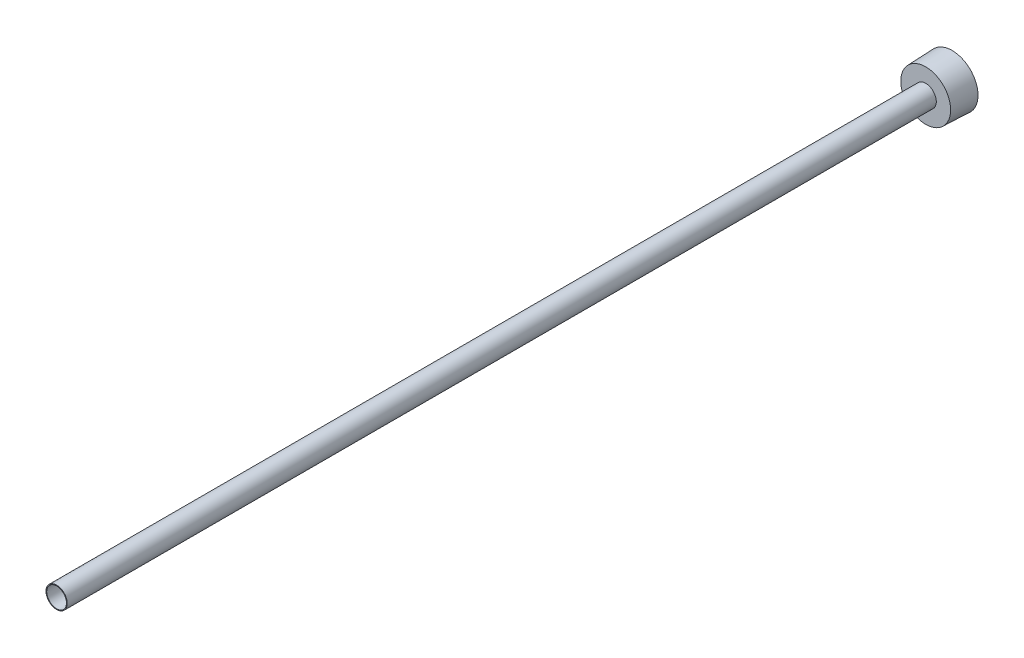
ISO-10303-21;
HEADER;
FILE_DESCRIPTION(('STEP AP214'),'2;1');
FILE_NAME('part.step','',(''),(''),'','','');
FILE_SCHEMA(('AUTOMOTIVE_DESIGN { 1 0 10303 214 1 1 1 1 }'));
ENDSEC;
DATA;
#1=APPLICATION_CONTEXT('core data for automotive mechanical design processes');
#2=APPLICATION_PROTOCOL_DEFINITION('international standard','automotive_design',2000,#1);
#3=PRODUCT_CONTEXT('',#1,'mechanical');
#4=PRODUCT('Part','Part','',(#3));
#5=PRODUCT_RELATED_PRODUCT_CATEGORY('part','',(#4));
#6=PRODUCT_DEFINITION_FORMATION('','',#4);
#7=PRODUCT_DEFINITION_CONTEXT('part definition',#1,'design');
#8=PRODUCT_DEFINITION('design','',#6,#7);
#9=PRODUCT_DEFINITION_SHAPE('','',#8);
#10=(LENGTH_UNIT() NAMED_UNIT(*) SI_UNIT(.MILLI.,.METRE.));
#11=(NAMED_UNIT(*) PLANE_ANGLE_UNIT() SI_UNIT($,.RADIAN.));
#12=(NAMED_UNIT(*) SI_UNIT($,.STERADIAN.) SOLID_ANGLE_UNIT());
#13=UNCERTAINTY_MEASURE_WITH_UNIT(LENGTH_MEASURE(1.E-05),#10,'distance_accuracy_value','');
#14=(GEOMETRIC_REPRESENTATION_CONTEXT(3) GLOBAL_UNCERTAINTY_ASSIGNED_CONTEXT((#13)) GLOBAL_UNIT_ASSIGNED_CONTEXT((#10,
#11,#12)) REPRESENTATION_CONTEXT('',''));
#15=CARTESIAN_POINT('',(0.,0.,0.));
#16=DIRECTION('',(0.,0.,1.));
#17=DIRECTION('',(1.,0.,0.));
#18=AXIS2_PLACEMENT_3D('',#15,#16,#17);
#19=CARTESIAN_POINT('',(0.,0.,0.));
#20=DIRECTION('',(0.,0.,1.));
#21=DIRECTION('',(1.,0.,0.));
#22=AXIS2_PLACEMENT_3D('',#19,#20,#21);
#23=CYLINDRICAL_SURFACE('',#22,5.0419);
#24=CARTESIAN_POINT('',(0.,0.,457.2));
#25=DIRECTION('',(0.,0.,1.));
#26=DIRECTION('',(1.,0.,0.));
#27=AXIS2_PLACEMENT_3D('',#24,#25,#26);
#28=CIRCLE('',#27,5.0419);
#29=CARTESIAN_POINT('',(5.0419,0.,457.2));
#30=VERTEX_POINT('',#29);
#31=EDGE_CURVE('E142',#30,#30,#28,.T.);
#32=ORIENTED_EDGE('',*,*,#31,.T.);
#33=EDGE_LOOP('',(#32));
#34=FACE_BOUND('',#33,.T.);
#35=CARTESIAN_POINT('',(0.,0.,9.525));
#36=DIRECTION('',(0.,0.,-1.));
#37=DIRECTION('',(-1.,0.,0.));
#38=AXIS2_PLACEMENT_3D('',#35,#36,#37);
#39=CIRCLE('',#38,5.0419);
#40=CARTESIAN_POINT('',(-5.0419,0.,9.525));
#41=VERTEX_POINT('',#40);
#42=EDGE_CURVE('E37',#41,#41,#39,.F.);
#43=ORIENTED_EDGE('',*,*,#42,.F.);
#44=EDGE_LOOP('',(#43));
#45=FACE_BOUND('',#44,.T.);
#46=ADVANCED_FACE('F33',(#34,#45),#23,.F.);
#47=CARTESIAN_POINT('',(0.,5.42289999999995,457.2));
#48=DIRECTION('',(0.,0.,-1.));
#49=DIRECTION('',(-1.,0.,0.));
#50=AXIS2_PLACEMENT_3D('',#47,#48,#49);
#51=PLANE('',#50);
#52=ORIENTED_EDGE('',*,*,#31,.F.);
#53=EDGE_LOOP('',(#52));
#54=FACE_BOUND('',#53,.T.);
#55=CARTESIAN_POINT('',(0.,0.,457.2));
#56=DIRECTION('',(0.,0.,1.));
#57=DIRECTION('',(1.,0.,0.));
#58=AXIS2_PLACEMENT_3D('',#55,#56,#57);
#59=CIRCLE('',#58,5.42289999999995);
#60=CARTESIAN_POINT('',(5.42289999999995,0.,457.2));
#61=VERTEX_POINT('',#60);
#62=EDGE_CURVE('E145',#61,#61,#59,.T.);
#63=ORIENTED_EDGE('',*,*,#62,.T.);
#64=EDGE_LOOP('',(#63));
#65=FACE_BOUND('',#64,.T.);
#66=ADVANCED_FACE('F35',(#54,#65),#51,.F.);
#67=CARTESIAN_POINT('',(0.,0.,0.));
#68=DIRECTION('',(0.,0.,1.));
#69=DIRECTION('',(1.,0.,0.));
#70=AXIS2_PLACEMENT_3D('',#67,#68,#69);
#71=PLANE('',#70);
#72=DIRECTION('',(-0.866025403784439,-0.5,0.));
#73=VECTOR('',#72,1.);
#74=CARTESIAN_POINT('',(9.525,-5.49926131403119,0.));
#75=LINE('',#74,#73);
#76=CARTESIAN_POINT('',(9.525,-5.49926131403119,0.));
#77=VERTEX_POINT('',#76);
#78=CARTESIAN_POINT('',(0.,-10.9985226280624,0.));
#79=VERTEX_POINT('',#78);
#80=EDGE_CURVE('E124',#77,#79,#75,.T.);
#81=ORIENTED_EDGE('',*,*,#80,.F.);
#82=DIRECTION('',(0.,-1.,0.));
#83=VECTOR('',#82,1.);
#84=CARTESIAN_POINT('',(9.525,5.49926131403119,0.));
#85=LINE('',#84,#83);
#86=CARTESIAN_POINT('',(9.525,5.49926131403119,0.));
#87=VERTEX_POINT('',#86);
#88=EDGE_CURVE('E49',#87,#77,#85,.T.);
#89=ORIENTED_EDGE('',*,*,#88,.F.);
#90=DIRECTION('',(0.866025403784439,-0.5,0.));
#91=VECTOR('',#90,1.);
#92=CARTESIAN_POINT('',(0.,10.9985226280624,0.));
#93=LINE('',#92,#91);
#94=CARTESIAN_POINT('',(0.,10.9985226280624,0.));
#95=VERTEX_POINT('',#94);
#96=EDGE_CURVE('E133',#95,#87,#93,.T.);
#97=ORIENTED_EDGE('',*,*,#96,.F.);
#98=DIRECTION('',(0.866025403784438,0.5,0.));
#99=VECTOR('',#98,1.);
#100=CARTESIAN_POINT('',(-9.525,5.49926131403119,0.));
#101=LINE('',#100,#99);
#102=CARTESIAN_POINT('',(-9.525,5.49926131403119,0.));
#103=VERTEX_POINT('',#102);
#104=EDGE_CURVE('E131',#103,#95,#101,.T.);
#105=ORIENTED_EDGE('',*,*,#104,.F.);
#106=DIRECTION('',(0.,1.,0.));
#107=VECTOR('',#106,1.);
#108=CARTESIAN_POINT('',(-9.525,-5.49926131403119,0.));
#109=LINE('',#108,#107);
#110=CARTESIAN_POINT('',(-9.525,-5.49926131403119,0.));
#111=VERTEX_POINT('',#110);
#112=EDGE_CURVE('E97',#111,#103,#109,.T.);
#113=ORIENTED_EDGE('',*,*,#112,.F.);
#114=DIRECTION('',(-0.866025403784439,0.5,0.));
#115=VECTOR('',#114,1.);
#116=CARTESIAN_POINT('',(0.,-10.9985226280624,0.));
#117=LINE('',#116,#115);
#118=EDGE_CURVE('E127',#79,#111,#117,.T.);
#119=ORIENTED_EDGE('',*,*,#118,.F.);
#120=EDGE_LOOP('',(#81,#89,#97,#105,#113,#119));
#121=FACE_BOUND('',#120,.T.);
#122=CARTESIAN_POINT('',(0.,0.,0.));
#123=DIRECTION('',(0.,0.,1.));
#124=DIRECTION('',(1.,0.,0.));
#125=AXIS2_PLACEMENT_3D('',#122,#123,#124);
#126=CIRCLE('',#125,13.2207);
#127=CARTESIAN_POINT('',(13.2207,0.,0.));
#128=VERTEX_POINT('',#127);
#129=EDGE_CURVE('E11',#128,#128,#126,.T.);
#130=ORIENTED_EDGE('',*,*,#129,.F.);
#131=EDGE_LOOP('',(#130));
#132=FACE_BOUND('',#131,.T.);
#133=ADVANCED_FACE('F159',(#121,#132),#71,.F.);
#134=CARTESIAN_POINT('',(0.,0.,0.));
#135=DIRECTION('',(0.,0.,-1.));
#136=DIRECTION('',(-1.,0.,0.));
#137=AXIS2_PLACEMENT_3D('',#134,#135,#136);
#138=CONICAL_SURFACE('',#137,13.2207,0.0364599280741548);
#139=CARTESIAN_POINT('',(0.,0.,13.4874));
#140=DIRECTION('',(0.,0.,1.));
#141=DIRECTION('',(1.,0.,0.));
#142=AXIS2_PLACEMENT_3D('',#139,#140,#141);
#143=CIRCLE('',#142,12.7287323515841);
#144=CARTESIAN_POINT('',(12.7287323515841,0.,13.4874));
#145=VERTEX_POINT('',#144);
#146=EDGE_CURVE('E42',#145,#145,#143,.T.);
#147=ORIENTED_EDGE('',*,*,#146,.F.);
#148=EDGE_LOOP('',(#147));
#149=FACE_BOUND('',#148,.T.);
#150=ORIENTED_EDGE('',*,*,#129,.T.);
#151=EDGE_LOOP('',(#150));
#152=FACE_BOUND('',#151,.T.);
#153=ADVANCED_FACE('F156',(#149,#152),#138,.T.);
#154=CARTESIAN_POINT('',(0.,12.7287323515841,13.4874));
#155=DIRECTION('',(0.,0.,-1.));
#156=DIRECTION('',(-1.,0.,0.));
#157=AXIS2_PLACEMENT_3D('',#154,#155,#156);
#158=PLANE('',#157);
#159=CARTESIAN_POINT('',(0.,0.,13.4874));
#160=DIRECTION('',(0.,0.,1.));
#161=DIRECTION('',(1.,0.,0.));
#162=AXIS2_PLACEMENT_3D('',#159,#160,#161);
#163=CIRCLE('',#162,5.4229);
#164=CARTESIAN_POINT('',(5.4229,0.,13.4874));
#165=VERTEX_POINT('',#164);
#166=EDGE_CURVE('E148',#165,#165,#163,.T.);
#167=ORIENTED_EDGE('',*,*,#166,.F.);
#168=EDGE_LOOP('',(#167));
#169=FACE_BOUND('',#168,.T.);
#170=ORIENTED_EDGE('',*,*,#146,.T.);
#171=EDGE_LOOP('',(#170));
#172=FACE_BOUND('',#171,.T.);
#173=ADVANCED_FACE('F154',(#169,#172),#158,.F.);
#174=CARTESIAN_POINT('',(0.,0.,278.00111462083));
#175=DIRECTION('',(0.,0.,1.));
#176=DIRECTION('',(1.,0.,0.));
#177=AXIS2_PLACEMENT_3D('',#174,#175,#176);
#178=CYLINDRICAL_SURFACE('',#177,5.42289999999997);
#179=ORIENTED_EDGE('',*,*,#62,.F.);
#180=EDGE_LOOP('',(#179));
#181=FACE_BOUND('',#180,.T.);
#182=ORIENTED_EDGE('',*,*,#166,.T.);
#183=EDGE_LOOP('',(#182));
#184=FACE_BOUND('',#183,.T.);
#185=ADVANCED_FACE('F180',(#181,#184),#178,.T.);
#186=CARTESIAN_POINT('',(9.525,-5.49926131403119,9.525));
#187=DIRECTION('',(0.,0.,-1.));
#188=DIRECTION('',(-1.,0.,0.));
#189=AXIS2_PLACEMENT_3D('',#186,#187,#188);
#190=PLANE('',#189);
#191=DIRECTION('',(0.,-1.,0.));
#192=VECTOR('',#191,1.);
#193=CARTESIAN_POINT('',(9.525,5.49926131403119,9.525));
#194=LINE('',#193,#192);
#195=CARTESIAN_POINT('',(9.525,5.49926131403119,9.525));
#196=VERTEX_POINT('',#195);
#197=CARTESIAN_POINT('',(9.525,-5.49926131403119,9.525));
#198=VERTEX_POINT('',#197);
#199=EDGE_CURVE('E135',#196,#198,#194,.T.);
#200=ORIENTED_EDGE('',*,*,#199,.T.);
#201=DIRECTION('',(-0.866025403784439,-0.5,0.));
#202=VECTOR('',#201,1.);
#203=CARTESIAN_POINT('',(9.525,-5.49926131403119,9.525));
#204=LINE('',#203,#202);
#205=CARTESIAN_POINT('',(0.,-10.9985226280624,9.525));
#206=VERTEX_POINT('',#205);
#207=EDGE_CURVE('E118',#198,#206,#204,.T.);
#208=ORIENTED_EDGE('',*,*,#207,.T.);
#209=DIRECTION('',(-0.866025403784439,0.5,0.));
#210=VECTOR('',#209,1.);
#211=CARTESIAN_POINT('',(0.,-10.9985226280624,9.525));
#212=LINE('',#211,#210);
#213=CARTESIAN_POINT('',(-9.525,-5.49926131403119,9.525));
#214=VERTEX_POINT('',#213);
#215=EDGE_CURVE('E116',#206,#214,#212,.T.);
#216=ORIENTED_EDGE('',*,*,#215,.T.);
#217=DIRECTION('',(0.,1.,0.));
#218=VECTOR('',#217,1.);
#219=CARTESIAN_POINT('',(-9.525,-5.49926131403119,9.525));
#220=LINE('',#219,#218);
#221=CARTESIAN_POINT('',(-9.525,5.49926131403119,9.525));
#222=VERTEX_POINT('',#221);
#223=EDGE_CURVE('E94',#214,#222,#220,.T.);
#224=ORIENTED_EDGE('',*,*,#223,.T.);
#225=DIRECTION('',(0.866025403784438,0.5,0.));
#226=VECTOR('',#225,1.);
#227=CARTESIAN_POINT('',(-9.525,5.49926131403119,9.525));
#228=LINE('',#227,#226);
#229=CARTESIAN_POINT('',(0.,10.9985226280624,9.525));
#230=VERTEX_POINT('',#229);
#231=EDGE_CURVE('E105',#222,#230,#228,.T.);
#232=ORIENTED_EDGE('',*,*,#231,.T.);
#233=DIRECTION('',(0.866025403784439,-0.5,0.));
#234=VECTOR('',#233,1.);
#235=CARTESIAN_POINT('',(0.,10.9985226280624,9.525));
#236=LINE('',#235,#234);
#237=EDGE_CURVE('E109',#230,#196,#236,.T.);
#238=ORIENTED_EDGE('',*,*,#237,.T.);
#239=EDGE_LOOP('',(#200,#208,#216,#224,#232,#238));
#240=FACE_BOUND('',#239,.T.);
#241=ORIENTED_EDGE('',*,*,#42,.T.);
#242=EDGE_LOOP('',(#241));
#243=FACE_BOUND('',#242,.T.);
#244=ADVANCED_FACE('F112',(#240,#243),#190,.T.);
#245=CARTESIAN_POINT('',(9.525,5.49926131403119,9.525));
#246=DIRECTION('',(1.,0.,0.));
#247=DIRECTION('',(0.,1.,0.));
#248=AXIS2_PLACEMENT_3D('',#245,#246,#247);
#249=PLANE('',#248);
#250=ORIENTED_EDGE('',*,*,#88,.T.);
#251=DIRECTION('',(0.,0.,-1.));
#252=VECTOR('',#251,1.);
#253=CARTESIAN_POINT('',(9.525,-5.49926131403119,9.525));
#254=LINE('',#253,#252);
#255=EDGE_CURVE('E79',#198,#77,#254,.T.);
#256=ORIENTED_EDGE('',*,*,#255,.F.);
#257=ORIENTED_EDGE('',*,*,#199,.F.);
#258=DIRECTION('',(0.,0.,-1.));
#259=VECTOR('',#258,1.);
#260=CARTESIAN_POINT('',(9.525,5.49926131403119,9.525));
#261=LINE('',#260,#259);
#262=EDGE_CURVE('E57',#196,#87,#261,.T.);
#263=ORIENTED_EDGE('',*,*,#262,.T.);
#264=EDGE_LOOP('',(#250,#256,#257,#263));
#265=FACE_BOUND('',#264,.T.);
#266=ADVANCED_FACE('F178',(#265),#249,.F.);
#267=CARTESIAN_POINT('',(0.,10.9985226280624,9.525));
#268=DIRECTION('',(0.5,0.866025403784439,0.));
#269=DIRECTION('',(-0.866025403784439,0.5,0.));
#270=AXIS2_PLACEMENT_3D('',#267,#268,#269);
#271=PLANE('',#270);
#272=ORIENTED_EDGE('',*,*,#96,.T.);
#273=ORIENTED_EDGE('',*,*,#262,.F.);
#274=ORIENTED_EDGE('',*,*,#237,.F.);
#275=DIRECTION('',(0.,0.,-1.));
#276=VECTOR('',#275,1.);
#277=CARTESIAN_POINT('',(0.,10.9985226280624,9.525));
#278=LINE('',#277,#276);
#279=EDGE_CURVE('E101',#230,#95,#278,.T.);
#280=ORIENTED_EDGE('',*,*,#279,.T.);
#281=EDGE_LOOP('',(#272,#273,#274,#280));
#282=FACE_BOUND('',#281,.T.);
#283=ADVANCED_FACE('F209',(#282),#271,.F.);
#284=CARTESIAN_POINT('',(-9.525,5.49926131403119,9.525));
#285=DIRECTION('',(-0.5,0.866025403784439,0.));
#286=DIRECTION('',(-0.866025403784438,-0.5,0.));
#287=AXIS2_PLACEMENT_3D('',#284,#285,#286);
#288=PLANE('',#287);
#289=ORIENTED_EDGE('',*,*,#104,.T.);
#290=ORIENTED_EDGE('',*,*,#279,.F.);
#291=ORIENTED_EDGE('',*,*,#231,.F.);
#292=DIRECTION('',(0.,0.,-1.));
#293=VECTOR('',#292,1.);
#294=CARTESIAN_POINT('',(-9.525,5.49926131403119,9.525));
#295=LINE('',#294,#293);
#296=EDGE_CURVE('E90',#222,#103,#295,.T.);
#297=ORIENTED_EDGE('',*,*,#296,.T.);
#298=EDGE_LOOP('',(#289,#290,#291,#297));
#299=FACE_BOUND('',#298,.T.);
#300=ADVANCED_FACE('F106',(#299),#288,.F.);
#301=CARTESIAN_POINT('',(-9.525,-5.49926131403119,9.525));
#302=DIRECTION('',(-1.,0.,0.));
#303=DIRECTION('',(0.,-1.,0.));
#304=AXIS2_PLACEMENT_3D('',#301,#302,#303);
#305=PLANE('',#304);
#306=ORIENTED_EDGE('',*,*,#112,.T.);
#307=ORIENTED_EDGE('',*,*,#296,.F.);
#308=ORIENTED_EDGE('',*,*,#223,.F.);
#309=DIRECTION('',(0.,0.,-1.));
#310=VECTOR('',#309,1.);
#311=CARTESIAN_POINT('',(-9.525,-5.49926131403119,9.525));
#312=LINE('',#311,#310);
#313=EDGE_CURVE('E102',#214,#111,#312,.T.);
#314=ORIENTED_EDGE('',*,*,#313,.T.);
#315=EDGE_LOOP('',(#306,#307,#308,#314));
#316=FACE_BOUND('',#315,.T.);
#317=ADVANCED_FACE('F92',(#316),#305,.F.);
#318=CARTESIAN_POINT('',(0.,-10.9985226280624,9.525));
#319=DIRECTION('',(-0.5,-0.866025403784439,0.));
#320=DIRECTION('',(0.866025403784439,-0.5,0.));
#321=AXIS2_PLACEMENT_3D('',#318,#319,#320);
#322=PLANE('',#321);
#323=ORIENTED_EDGE('',*,*,#118,.T.);
#324=ORIENTED_EDGE('',*,*,#313,.F.);
#325=ORIENTED_EDGE('',*,*,#215,.F.);
#326=DIRECTION('',(0.,0.,-1.));
#327=VECTOR('',#326,1.);
#328=CARTESIAN_POINT('',(0.,-10.9985226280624,9.525));
#329=LINE('',#328,#327);
#330=EDGE_CURVE('E139',#206,#79,#329,.T.);
#331=ORIENTED_EDGE('',*,*,#330,.T.);
#332=EDGE_LOOP('',(#323,#324,#325,#331));
#333=FACE_BOUND('',#332,.T.);
#334=ADVANCED_FACE('F227',(#333),#322,.F.);
#335=CARTESIAN_POINT('',(9.525,-5.49926131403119,9.525));
#336=DIRECTION('',(0.5,-0.866025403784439,0.));
#337=DIRECTION('',(0.866025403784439,0.5,0.));
#338=AXIS2_PLACEMENT_3D('',#335,#336,#337);
#339=PLANE('',#338);
#340=ORIENTED_EDGE('',*,*,#80,.T.);
#341=ORIENTED_EDGE('',*,*,#330,.F.);
#342=ORIENTED_EDGE('',*,*,#207,.F.);
#343=ORIENTED_EDGE('',*,*,#255,.T.);
#344=EDGE_LOOP('',(#340,#341,#342,#343));
#345=FACE_BOUND('',#344,.T.);
#346=ADVANCED_FACE('F234',(#345),#339,.F.);
#347=CLOSED_SHELL('',(#46,#66,#133,#153,#173,#185,#244,#266,#283,#300,#317,#334,#346));
#348=MANIFOLD_SOLID_BREP('B2',#347);
#349=ADVANCED_BREP_SHAPE_REPRESENTATION('',(#18,#348),#14);
#350=SHAPE_DEFINITION_REPRESENTATION(#9,#349);
ENDSEC;
END-ISO-10303-21;
